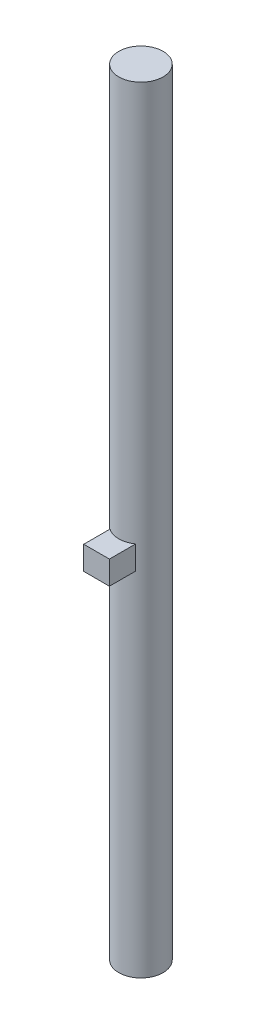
from build123d import *

# Parameters (mm, degrees)
SKETCH2_R           = 1
BOSS_EXTRUDE1_DEPTH = 35
SKETCH3_W           = 1.15800818
SKETCH3_H           = 1.061507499
BOSS_EXTRUDE2_DEPTH = 2


with BuildPart() as part:
    # Sketch2 → Boss-Extrude1 (new body)
    with BuildSketch(Plane(origin=(0, 0, 0), x_dir=(1, 0, 0), z_dir=(0, 1, 0))):
        with Locations(Location((0, 0, 0), (0, 0, 270))):
            Circle(SKETCH2_R)
    extrude(amount=BOSS_EXTRUDE1_DEPTH)

    # Sketch3 → Boss-Extrude2 (add)
    with BuildSketch(Plane.XY):
        with Locations((0, 16.420340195)):
            Rectangle(SKETCH3_W, SKETCH3_H)
    extrude(amount=BOSS_EXTRUDE2_DEPTH)


solid = part.part
